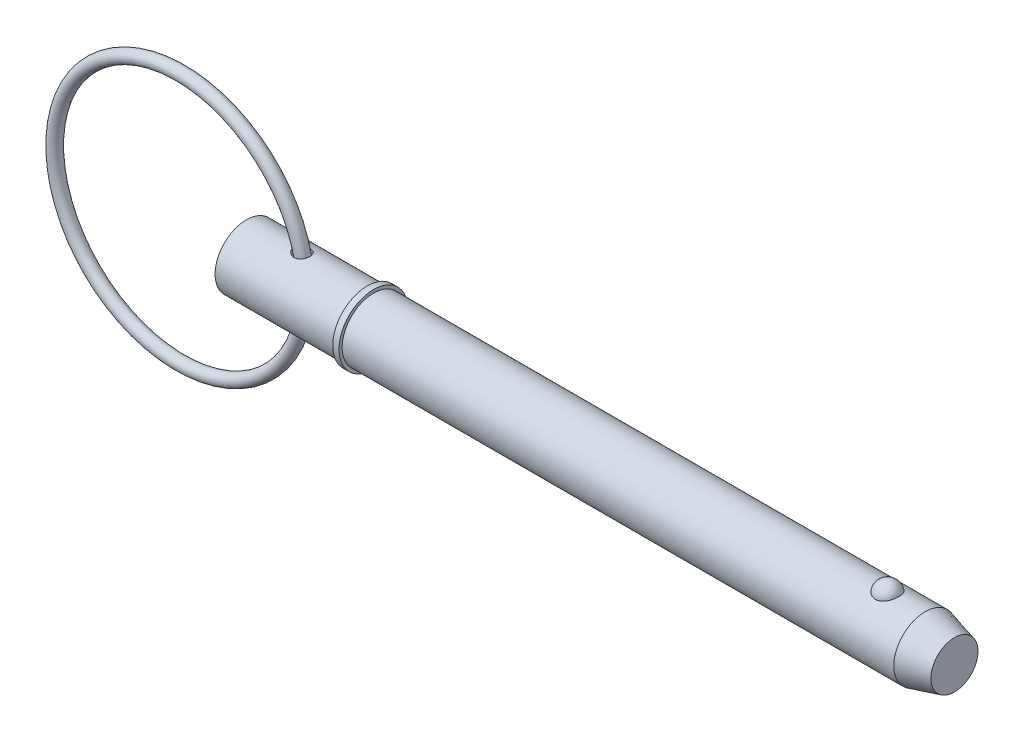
ISO-10303-21;
HEADER;
FILE_DESCRIPTION(('STEP AP214'),'2;1');
FILE_NAME('part.step','',(''),(''),'','','');
FILE_SCHEMA(('AUTOMOTIVE_DESIGN { 1 0 10303 214 1 1 1 1 }'));
ENDSEC;
DATA;
#1=APPLICATION_CONTEXT('core data for automotive mechanical design processes');
#2=APPLICATION_PROTOCOL_DEFINITION('international standard','automotive_design',2000,#1);
#3=PRODUCT_CONTEXT('',#1,'mechanical');
#4=PRODUCT('Part','Part','',(#3));
#5=PRODUCT_RELATED_PRODUCT_CATEGORY('part','',(#4));
#6=PRODUCT_DEFINITION_FORMATION('','',#4);
#7=PRODUCT_DEFINITION_CONTEXT('part definition',#1,'design');
#8=PRODUCT_DEFINITION('design','',#6,#7);
#9=PRODUCT_DEFINITION_SHAPE('','',#8);
#10=(LENGTH_UNIT() NAMED_UNIT(*) SI_UNIT(.MILLI.,.METRE.));
#11=(NAMED_UNIT(*) PLANE_ANGLE_UNIT() SI_UNIT($,.RADIAN.));
#12=(NAMED_UNIT(*) SI_UNIT($,.STERADIAN.) SOLID_ANGLE_UNIT());
#13=UNCERTAINTY_MEASURE_WITH_UNIT(LENGTH_MEASURE(1.E-05),#10,'distance_accuracy_value','');
#14=(GEOMETRIC_REPRESENTATION_CONTEXT(3) GLOBAL_UNCERTAINTY_ASSIGNED_CONTEXT((#13)) GLOBAL_UNIT_ASSIGNED_CONTEXT((#10,
#11,#12)) REPRESENTATION_CONTEXT('',''));
#15=CARTESIAN_POINT('',(0.,0.,0.));
#16=DIRECTION('',(0.,0.,1.));
#17=DIRECTION('',(1.,0.,0.));
#18=AXIS2_PLACEMENT_3D('',#15,#16,#17);
#19=CARTESIAN_POINT('',(-13.3798047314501,0.,0.));
#20=DIRECTION('',(0.,0.,1.));
#21=DIRECTION('',(1.,0.,0.));
#22=AXIS2_PLACEMENT_3D('',#19,#20,#21);
#23=TOROIDAL_SURFACE('',#22,25.4,1.27);
#24=CARTESIAN_POINT('',(13.2901952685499,0.,0.));
#25=VERTEX_POINT('',#24);
#26=VERTEX_LOOP('',#25);
#27=FACE_BOUND('',#26,.T.);
#28=ADVANCED_FACE('P0_F12',(#27),#23,.T.);
#29=CLOSED_SHELL('',(#28));
#30=MANIFOLD_SOLID_BREP('P0_B1',#29);
#31=CARTESIAN_POINT('',(0.,0.,0.));
#32=DIRECTION('',(1.,0.,0.));
#33=DIRECTION('',(0.,0.,-1.));
#34=AXIS2_PLACEMENT_3D('',#31,#32,#33);
#35=CYLINDRICAL_SURFACE('',#34,6.35);
#36=CARTESIAN_POINT('',(9.67500140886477,6.32698634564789,-0.540133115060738));
#37=CARTESIAN_POINT('',(9.70878953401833,6.3197498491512,-0.624879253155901));
#38=CARTESIAN_POINT('',(9.75028044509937,6.31105328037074,-0.706504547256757));
#39=CARTESIAN_POINT('',(9.84659255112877,6.29180070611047,-0.861319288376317));
#40=CARTESIAN_POINT('',(9.90144039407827,6.28124099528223,-0.934491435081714));
#41=CARTESIAN_POINT('',(10.021999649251,6.25949497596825,-1.0704877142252));
#42=CARTESIAN_POINT('',(10.0876589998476,6.2483118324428,-1.1333586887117));
#43=CARTESIAN_POINT('',(10.2280180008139,6.22641783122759,-1.24805262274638));
#44=CARTESIAN_POINT('',(10.3027159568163,6.21570688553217,-1.29987764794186));
#45=CARTESIAN_POINT('',(10.4650889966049,6.19509606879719,-1.39492899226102));
#46=CARTESIAN_POINT('',(10.5533142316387,6.1853135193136,-1.4372443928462));
#47=CARTESIAN_POINT('',(10.7357818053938,6.16871128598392,-1.50691441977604));
#48=CARTESIAN_POINT('',(10.8300253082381,6.16189217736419,-1.53426614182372));
#49=CARTESIAN_POINT('',(11.0227953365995,6.15211299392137,-1.57302798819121));
#50=CARTESIAN_POINT('',(11.1213511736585,6.14918579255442,-1.58430237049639));
#51=CARTESIAN_POINT('',(11.3189518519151,6.1478413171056,-1.58951619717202));
#52=CARTESIAN_POINT('',(11.417996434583,6.14942187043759,-1.58346399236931));
#53=CARTESIAN_POINT('',(11.6070859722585,6.15678569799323,-1.55457003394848));
#54=CARTESIAN_POINT('',(11.6973059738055,6.16229943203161,-1.53280404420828));
#55=CARTESIAN_POINT('',(11.8723373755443,6.176630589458,-1.4739892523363));
#56=CARTESIAN_POINT('',(11.9571502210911,6.185447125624,-1.43694455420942));
#57=CARTESIAN_POINT('',(12.1146737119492,6.20482821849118,-1.3507217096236));
#58=CARTESIAN_POINT('',(12.1877743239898,6.21528554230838,-1.30222952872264));
#59=CARTESIAN_POINT('',(12.324618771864,6.23705116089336,-1.19362916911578));
#60=CARTESIAN_POINT('',(12.3883628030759,6.24835943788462,-1.1335212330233));
#61=CARTESIAN_POINT('',(12.5046662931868,6.27053957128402,-1.00357204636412));
#62=CARTESIAN_POINT('',(12.5572571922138,6.28141258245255,-0.933759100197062));
#63=CARTESIAN_POINT('',(12.6502125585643,6.30157953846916,-0.786214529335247));
#64=CARTESIAN_POINT('',(12.6905764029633,6.31087340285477,-0.708482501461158));
#65=CARTESIAN_POINT('',(12.7585531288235,6.32699259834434,-0.546246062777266));
#66=CARTESIAN_POINT('',(12.7860022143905,6.33378599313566,-0.461669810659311));
#67=CARTESIAN_POINT('',(12.8267605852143,6.34401050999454,-0.288980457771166));
#68=CARTESIAN_POINT('',(12.8400695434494,6.34744155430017,-0.200867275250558));
#69=CARTESIAN_POINT('',(12.8522644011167,6.35058177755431,-0.0231943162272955));
#70=CARTESIAN_POINT('',(12.8510870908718,6.35027464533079,0.0663700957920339));
#71=CARTESIAN_POINT('',(12.8341831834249,6.34593169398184,0.244024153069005));
#72=CARTESIAN_POINT('',(12.8184563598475,6.341895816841,0.332113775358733));
#73=CARTESIAN_POINT('',(12.7728208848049,6.33052992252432,0.504322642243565));
#74=CARTESIAN_POINT('',(12.7429114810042,6.32319973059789,0.588441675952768));
#75=CARTESIAN_POINT('',(12.6696162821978,6.30604116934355,0.750316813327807));
#76=CARTESIAN_POINT('',(12.6262302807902,6.29621276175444,0.828072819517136));
#77=CARTESIAN_POINT('',(12.5270856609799,6.27515240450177,0.974918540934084));
#78=CARTESIAN_POINT('',(12.4713403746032,6.26392197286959,1.04401746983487));
#79=CARTESIAN_POINT('',(12.3488662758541,6.24131002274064,1.1716478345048));
#80=CARTESIAN_POINT('',(12.2821384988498,6.22992851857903,1.23018026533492));
#81=CARTESIAN_POINT('',(12.1401870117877,6.20841765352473,1.33449214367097));
#82=CARTESIAN_POINT('',(12.0650507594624,6.19827734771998,1.38038832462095));
#83=CARTESIAN_POINT('',(11.9079044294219,6.18026478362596,1.45892404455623));
#84=CARTESIAN_POINT('',(11.8258951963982,6.17239224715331,1.49156520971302));
#85=CARTESIAN_POINT('',(11.6581736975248,6.15982613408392,1.54263810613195));
#86=CARTESIAN_POINT('',(11.572502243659,6.15510409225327,1.56119728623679));
#87=CARTESIAN_POINT('',(11.3991899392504,6.14916283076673,1.58443707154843));
#88=CARTESIAN_POINT('',(11.3115488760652,6.14794399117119,1.58911617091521));
#89=CARTESIAN_POINT('',(11.1345547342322,6.14904466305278,1.58485137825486));
#90=CARTESIAN_POINT('',(11.0452104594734,6.15144894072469,1.5755811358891));
#91=CARTESIAN_POINT('',(10.8691479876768,6.15957601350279,1.54349959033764));
#92=CARTESIAN_POINT('',(10.782430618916,6.16529984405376,1.52068406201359));
#93=CARTESIAN_POINT('',(10.6082848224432,6.17983892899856,1.4605156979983));
#94=CARTESIAN_POINT('',(10.5211557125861,6.1888262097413,1.42233764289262));
#95=CARTESIAN_POINT('',(10.3542377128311,6.20874782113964,1.33268652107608));
#96=CARTESIAN_POINT('',(10.2744521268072,6.21968302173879,1.28120750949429));
#97=CARTESIAN_POINT('',(10.120854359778,6.24282707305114,1.16334748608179));
#98=CARTESIAN_POINT('',(10.0474902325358,6.25507146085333,1.09638652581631));
#99=CARTESIAN_POINT('',(9.91368693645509,6.27890019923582,0.950453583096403));
#100=CARTESIAN_POINT('',(9.85324511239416,6.29048468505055,0.87148407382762));
#101=CARTESIAN_POINT('',(9.75037543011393,6.31102161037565,0.707140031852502));
#102=CARTESIAN_POINT('',(9.70726585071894,6.32006820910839,0.622206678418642));
#103=CARTESIAN_POINT('',(9.63775895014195,6.33497125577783,0.445490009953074));
#104=CARTESIAN_POINT('',(9.61134627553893,6.34083063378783,0.35371307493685));
#105=CARTESIAN_POINT('',(9.57891955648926,6.34807071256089,0.177220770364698));
#106=CARTESIAN_POINT('',(9.5709352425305,6.3498832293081,0.0928817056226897));
#107=CARTESIAN_POINT('',(9.56994851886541,6.35010532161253,-0.0758268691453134));
#108=CARTESIAN_POINT('',(9.57692695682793,6.34851924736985,-0.160196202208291));
#109=CARTESIAN_POINT('',(9.59985709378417,6.34339435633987,-0.294043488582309));
#110=CARTESIAN_POINT('',(9.61128951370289,6.34084912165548,-0.34438537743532));
#111=CARTESIAN_POINT('',(9.63933183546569,6.33468615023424,-0.443526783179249));
#112=CARTESIAN_POINT('',(9.65594100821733,6.33106856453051,-0.492326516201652));
#113=CARTESIAN_POINT('',(9.67500140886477,6.32698634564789,-0.540133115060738));
#114=B_SPLINE_CURVE_WITH_KNOTS('',3,(#36,#37,#38,#39,#40,#41,#42,#43,#44,#45,#46,#47,#48,#49,
#50,#51,#52,#53,#54,#55,#56,#57,#58,#59,#60,#61,#62,#63,#64,#65,#66,#67,#68,#69,#70,#71,#72,#73,
#74,#75,#76,#77,#78,#79,#80,#81,#82,#83,#84,#85,#86,#87,#88,#89,#90,#91,#92,#93,#94,#95,#96,#97,
#98,#99,#100,#101,#102,#103,#104,#105,#106,#107,#108,#109,#110,#111,#112,#113),.UNSPECIFIED.,
.T.,.F.,(4,2,2,2,2,2,2,2,2,2,2,2,2,2,2,2,2,2,2,2,2,2,2,2,2,2,2,2,2,2,2,2,2,2,2,2,2,2,4),(0.,
0.274348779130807,0.54924945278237,0.822863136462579,1.09642560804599,1.3900770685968,
1.68378550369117,1.97995934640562,2.27599046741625,2.55347281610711,2.83088067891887,
3.09465189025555,3.35841759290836,3.62142956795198,3.88445494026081,4.1507318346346,
4.4170148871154,4.68446025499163,4.95190978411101,5.21937350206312,5.48684131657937,
5.75402200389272,6.02117751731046,6.28577524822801,6.55034050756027,6.81248178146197,
7.0746514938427,7.34305086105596,7.61153399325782,7.89692981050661,8.18245340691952,
8.48120635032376,8.77989784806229,9.06530254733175,9.35044442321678,9.60331609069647,
9.85586427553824,10.010650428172,10.1654147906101),.UNSPECIFIED.);
#115=CARTESIAN_POINT('',(9.67500140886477,6.32698634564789,-0.540133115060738));
#116=VERTEX_POINT('',#115);
#117=EDGE_CURVE('P1_E42',#116,#116,#114,.T.);
#118=ORIENTED_EDGE('',*,*,#117,.T.);
#119=EDGE_LOOP('',(#118));
#120=FACE_BOUND('',#119,.T.);
#121=CARTESIAN_POINT('',(0.,0.,0.));
#122=DIRECTION('',(1.,0.,0.));
#123=DIRECTION('',(0.,0.,-1.));
#124=AXIS2_PLACEMENT_3D('',#121,#122,#123);
#125=CIRCLE('',#124,6.35);
#126=CARTESIAN_POINT('',(0.,0.,-6.35));
#127=VERTEX_POINT('',#126);
#128=EDGE_CURVE('P1_E9',#127,#127,#125,.T.);
#129=ORIENTED_EDGE('',*,*,#128,.T.);
#130=EDGE_LOOP('',(#129));
#131=FACE_BOUND('',#130,.T.);
#132=CARTESIAN_POINT('',(24.43,0.,0.));
#133=DIRECTION('',(1.,0.,0.));
#134=DIRECTION('',(0.,0.,-1.));
#135=AXIS2_PLACEMENT_3D('',#132,#133,#134);
#136=CIRCLE('',#135,6.35);
#137=CARTESIAN_POINT('',(24.43,0.,-6.35));
#138=VERTEX_POINT('',#137);
#139=EDGE_CURVE('P1_E25',#138,#138,#136,.T.);
#140=ORIENTED_EDGE('',*,*,#139,.F.);
#141=EDGE_LOOP('',(#140));
#142=FACE_BOUND('',#141,.T.);
#143=CARTESIAN_POINT('',(9.67500140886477,-6.32698634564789,-0.540133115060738));
#144=CARTESIAN_POINT('',(9.64544894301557,-6.33331515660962,-0.46600258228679));
#145=CARTESIAN_POINT('',(9.62177180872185,-6.33852974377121,-0.389437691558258));
#146=CARTESIAN_POINT('',(9.58727043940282,-6.34619174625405,-0.233330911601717));
#147=CARTESIAN_POINT('',(9.57644043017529,-6.34864040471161,-0.153790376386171));
#148=CARTESIAN_POINT('',(9.56819517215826,-6.3505010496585,0.00612071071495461));
#149=CARTESIAN_POINT('',(9.57079639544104,-6.34990930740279,0.0864921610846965));
#150=CARTESIAN_POINT('',(9.58930797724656,-6.3457478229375,0.245607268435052));
#151=CARTESIAN_POINT('',(9.60522046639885,-6.34217760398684,0.324350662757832));
#152=CARTESIAN_POINT('',(9.64931570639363,-6.3324977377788,0.47727605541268));
#153=CARTESIAN_POINT('',(9.67737525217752,-6.32641361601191,0.551495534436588));
#154=CARTESIAN_POINT('',(9.74451510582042,-6.31231128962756,0.69455132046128));
#155=CARTESIAN_POINT('',(9.78359827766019,-6.30429258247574,0.763386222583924));
#156=CARTESIAN_POINT('',(9.87474700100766,-6.28638332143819,0.899414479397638));
#157=CARTESIAN_POINT('',(9.92757481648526,-6.27639669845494,0.966083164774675));
#158=CARTESIAN_POINT('',(10.042675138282,-6.25596164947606,1.09061181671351));
#159=CARTESIAN_POINT('',(10.1049521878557,-6.24551300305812,1.14846751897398));
#160=CARTESIAN_POINT('',(10.2445505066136,-6.22397505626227,1.26024641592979));
#161=CARTESIAN_POINT('',(10.3227711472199,-6.2129394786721,1.31305951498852));
#162=CARTESIAN_POINT('',(10.4867924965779,-6.19263757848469,1.40570084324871));
#163=CARTESIAN_POINT('',(10.5725962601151,-6.18337197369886,1.44552380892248));
#164=CARTESIAN_POINT('',(10.7543302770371,-6.16725983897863,1.51283687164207));
#165=CARTESIAN_POINT('',(10.8505554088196,-6.16056505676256,1.53957358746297));
#166=CARTESIAN_POINT('',(11.0463546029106,-6.15127671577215,1.57628137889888));
#167=CARTESIAN_POINT('',(11.1459276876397,-6.14868197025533,1.58625730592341));
#168=CARTESIAN_POINT('',(11.3414257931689,-6.14810798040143,1.58848000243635));
#169=CARTESIAN_POINT('',(11.4373417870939,-6.14995283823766,1.58140242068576));
#170=CARTESIAN_POINT('',(11.6262783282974,-6.1577972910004,1.55057566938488));
#171=CARTESIAN_POINT('',(11.719300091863,-6.16379511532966,1.52683360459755));
#172=CARTESIAN_POINT('',(11.8934223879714,-6.17873566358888,1.46514575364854));
#173=CARTESIAN_POINT('',(11.9749048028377,-6.18746207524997,1.42822144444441));
#174=CARTESIAN_POINT('',(12.1301362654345,-6.20693584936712,1.34105645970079));
#175=CARTESIAN_POINT('',(12.2038861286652,-6.21768299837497,1.29081719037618));
#176=CARTESIAN_POINT('',(12.3399792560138,-6.23970077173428,1.17972764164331));
#177=CARTESIAN_POINT('',(12.4025430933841,-6.25095401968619,1.11914355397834));
#178=CARTESIAN_POINT('',(12.5166805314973,-6.27296916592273,0.988307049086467));
#179=CARTESIAN_POINT('',(12.568253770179,-6.28373104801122,0.918054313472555));
#180=CARTESIAN_POINT('',(12.6596230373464,-6.3037060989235,0.769081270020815));
#181=CARTESIAN_POINT('',(12.6992956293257,-6.31290263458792,0.690283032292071));
#182=CARTESIAN_POINT('',(12.7652258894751,-6.32862394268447,0.527011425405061));
#183=CARTESIAN_POINT('',(12.7914829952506,-6.33514860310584,0.442537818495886));
#184=CARTESIAN_POINT('',(12.8301436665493,-6.34487485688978,0.269505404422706));
#185=CARTESIAN_POINT('',(12.8424230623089,-6.34804664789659,0.180917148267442));
#186=CARTESIAN_POINT('',(12.8524214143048,-6.35062347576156,0.00286829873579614));
#187=CARTESIAN_POINT('',(12.8501402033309,-6.35002846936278,-0.0865923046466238));
#188=CARTESIAN_POINT('',(12.8310619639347,-6.34513332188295,-0.263931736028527));
#189=CARTESIAN_POINT('',(12.8142517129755,-6.34082980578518,-0.35180904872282));
#190=CARTESIAN_POINT('',(12.7664911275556,-6.32897674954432,-0.523406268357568));
#191=CARTESIAN_POINT('',(12.7355404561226,-6.3214271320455,-0.607126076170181));
#192=CARTESIAN_POINT('',(12.6602298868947,-6.30390232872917,-0.768030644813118));
#193=CARTESIAN_POINT('',(12.6158695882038,-6.29392707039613,-0.845215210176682));
#194=CARTESIAN_POINT('',(12.5148171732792,-6.2726521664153,-0.990836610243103));
#195=CARTESIAN_POINT('',(12.4581254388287,-6.26135256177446,-1.05927371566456));
#196=CARTESIAN_POINT('',(12.33416419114,-6.2387572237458,-1.18510935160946));
#197=CARTESIAN_POINT('',(12.2669484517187,-6.22746174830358,-1.24256086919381));
#198=CARTESIAN_POINT('',(12.1235592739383,-6.20610255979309,-1.34519464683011));
#199=CARTESIAN_POINT('',(12.0473871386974,-6.19603866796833,-1.39037868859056));
#200=CARTESIAN_POINT('',(11.8892714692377,-6.17839642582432,-1.46678006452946));
#201=CARTESIAN_POINT('',(11.8074126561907,-6.17078838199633,-1.49816605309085));
#202=CARTESIAN_POINT('',(11.6394563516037,-6.15869606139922,-1.54712759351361));
#203=CARTESIAN_POINT('',(11.5533589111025,-6.15421174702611,-1.56470331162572));
#204=CARTESIAN_POINT('',(11.3789660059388,-6.14876652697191,-1.58596734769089));
#205=CARTESIAN_POINT('',(11.2906621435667,-6.1478222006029,-1.58959032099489));
#206=CARTESIAN_POINT('',(11.1146029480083,-6.149490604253,-1.58312110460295));
#207=CARTESIAN_POINT('',(11.0268477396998,-6.1521041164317,-1.57302589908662));
#208=CARTESIAN_POINT('',(10.8498668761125,-6.16071031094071,-1.53898332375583));
#209=CARTESIAN_POINT('',(10.7607726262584,-6.16685908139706,-1.51439468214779));
#210=CARTESIAN_POINT('',(10.5876521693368,-6.18189031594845,-1.45181305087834));
#211=CARTESIAN_POINT('',(10.5036282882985,-6.19077402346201,-1.41381396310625));
#212=CARTESIAN_POINT('',(10.3374228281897,-6.2109378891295,-1.32252480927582));
#213=CARTESIAN_POINT('',(10.255708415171,-6.2223355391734,-1.26840756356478));
#214=CARTESIAN_POINT('',(10.1025645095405,-6.24580740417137,-1.14725208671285));
#215=CARTESIAN_POINT('',(10.0311354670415,-6.25788164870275,-1.08021329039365));
#216=CARTESIAN_POINT('',(9.90472699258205,-6.2806176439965,-0.938710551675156));
#217=CARTESIAN_POINT('',(9.84904456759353,-6.29132066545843,-0.864883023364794));
#218=CARTESIAN_POINT('',(9.75129345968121,-6.31084098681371,-0.708496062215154));
#219=CARTESIAN_POINT('',(9.70921094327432,-6.31966019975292,-0.625945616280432));
#220=CARTESIAN_POINT('',(9.67500140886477,-6.32698634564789,-0.540133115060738));
#221=B_SPLINE_CURVE_WITH_KNOTS('',3,(#143,#144,#145,#146,#147,#148,#149,#150,#151,#152,#153,
#154,#155,#156,#157,#158,#159,#160,#161,#162,#163,#164,#165,#166,#167,#168,#169,#170,#171,#172,
#173,#174,#175,#176,#177,#178,#179,#180,#181,#182,#183,#184,#185,#186,#187,#188,#189,#190,#191,
#192,#193,#194,#195,#196,#197,#198,#199,#200,#201,#202,#203,#204,#205,#206,#207,#208,#209,#210,
#211,#212,#213,#214,#215,#216,#217,#218,#219,#220),.UNSPECIFIED.,.T.,.F.,(4,2,2,2,2,2,2,2,2,2,2,
2,2,2,2,2,2,2,2,2,2,2,2,2,2,2,2,2,2,2,2,2,2,2,2,2,2,2,4),(0.,0.239871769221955,
0.479635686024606,0.719693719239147,0.959790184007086,1.19750645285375,1.43528453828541,
1.69117930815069,1.94719750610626,2.23102979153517,2.51497694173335,2.81376497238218,
3.11246650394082,3.39952951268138,3.68647020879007,3.95479420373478,4.22308987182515,
4.48530700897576,4.74753278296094,5.01239119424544,5.27726070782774,5.54446524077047,
5.81167284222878,6.07912387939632,6.34658129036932,6.61404669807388,6.88150382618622,
7.1476364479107,7.41373039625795,7.67647472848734,7.93921589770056,8.20318607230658,
8.46721428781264,8.74390821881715,9.02072813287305,9.31537622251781,9.61003720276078,
9.88799314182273,10.1656654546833),.UNSPECIFIED.);
#222=CARTESIAN_POINT('',(9.67500140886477,-6.32698634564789,-0.540133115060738));
#223=VERTEX_POINT('',#222);
#224=EDGE_CURVE('P1_E17',#223,#223,#221,.T.);
#225=ORIENTED_EDGE('',*,*,#224,.T.);
#226=EDGE_LOOP('',(#225));
#227=FACE_BOUND('',#226,.T.);
#228=ADVANCED_FACE('P1_F13',(#120,#131,#142,#227),#35,.T.);
#229=CARTESIAN_POINT('',(0.,0.,0.));
#230=DIRECTION('',(1.,0.,0.));
#231=DIRECTION('',(0.,0.,-1.));
#232=AXIS2_PLACEMENT_3D('',#229,#230,#231);
#233=CYLINDRICAL_SURFACE('',#232,6.35);
#234=CARTESIAN_POINT('',(137.255369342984,0.,0.));
#235=DIRECTION('',(1.,0.,0.));
#236=DIRECTION('',(0.,0.,-1.));
#237=AXIS2_PLACEMENT_3D('',#234,#235,#236);
#238=CIRCLE('',#237,6.35);
#239=CARTESIAN_POINT('',(137.255369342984,0.,-6.35));
#240=VERTEX_POINT('',#239);
#241=EDGE_CURVE('P1_E99',#240,#240,#238,.T.);
#242=ORIENTED_EDGE('',*,*,#241,.F.);
#243=EDGE_LOOP('',(#242));
#244=FACE_BOUND('',#243,.T.);
#245=CARTESIAN_POINT('',(25.7,0.,0.));
#246=DIRECTION('',(1.,0.,0.));
#247=DIRECTION('',(0.,0.,-1.));
#248=AXIS2_PLACEMENT_3D('',#245,#246,#247);
#249=CIRCLE('',#248,6.35);
#250=CARTESIAN_POINT('',(25.7,0.,-6.35));
#251=VERTEX_POINT('',#250);
#252=EDGE_CURVE('P1_E96',#251,#251,#249,.T.);
#253=ORIENTED_EDGE('',*,*,#252,.T.);
#254=EDGE_LOOP('',(#253));
#255=FACE_BOUND('',#254,.T.);
#256=CARTESIAN_POINT('',(129.630021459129,5.87502187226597,2.40969251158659));
#257=CARTESIAN_POINT('',(129.505030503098,5.87501645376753,2.40969773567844));
#258=CARTESIAN_POINT('',(129.380080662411,5.87916061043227,2.39967292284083));
#259=CARTESIAN_POINT('',(129.133909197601,5.8952311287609,2.35991730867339));
#260=CARTESIAN_POINT('',(129.012686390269,5.90715499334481,2.33019283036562));
#261=CARTESIAN_POINT('',(128.777517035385,5.93739567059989,2.25201402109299));
#262=CARTESIAN_POINT('',(128.663560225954,5.95570321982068,2.20358681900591));
#263=CARTESIAN_POINT('',(128.44557352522,5.99672067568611,2.08937987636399));
#264=CARTESIAN_POINT('',(128.341545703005,6.01943149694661,2.02359652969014));
#265=CARTESIAN_POINT('',(128.142943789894,6.06760647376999,1.87428969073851));
#266=CARTESIAN_POINT('',(128.048726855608,6.09313095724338,1.79031110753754));
#267=CARTESIAN_POINT('',(127.875255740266,6.14375873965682,1.60800178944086));
#268=CARTESIAN_POINT('',(127.796004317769,6.16886196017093,1.50966841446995));
#269=CARTESIAN_POINT('',(127.650845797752,6.21724600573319,1.29645884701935));
#270=CARTESIAN_POINT('',(127.585688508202,6.24039621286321,1.18104158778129));
#271=CARTESIAN_POINT('',(127.474703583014,6.28117277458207,0.940351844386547));
#272=CARTESIAN_POINT('',(127.428877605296,6.29879865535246,0.815078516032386));
#273=CARTESIAN_POINT('',(127.357023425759,6.32692073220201,0.556494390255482));
#274=CARTESIAN_POINT('',(127.331249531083,6.33732517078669,0.423102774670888));
#275=CARTESIAN_POINT('',(127.300988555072,6.34957673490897,0.153542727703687));
#276=CARTESIAN_POINT('',(127.296500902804,6.35142408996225,0.0173743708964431));
#277=CARTESIAN_POINT('',(127.308865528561,6.34638925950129,-0.253036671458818));
#278=CARTESIAN_POINT('',(127.325594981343,6.33955731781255,-0.387285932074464));
#279=CARTESIAN_POINT('',(127.379843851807,6.31794129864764,-0.650851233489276));
#280=CARTESIAN_POINT('',(127.417363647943,6.30315707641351,-0.780167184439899));
#281=CARTESIAN_POINT('',(127.512500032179,6.26711642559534,-1.03041949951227));
#282=CARTESIAN_POINT('',(127.570143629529,6.24585130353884,-1.1513443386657));
#283=CARTESIAN_POINT('',(127.704352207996,6.19905619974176,-1.38129800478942));
#284=CARTESIAN_POINT('',(127.780918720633,6.17352587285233,-1.49032586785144));
#285=CARTESIAN_POINT('',(127.951753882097,6.12080227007,-1.69393164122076));
#286=CARTESIAN_POINT('',(128.046100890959,6.09360200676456,-1.78844209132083));
#287=CARTESIAN_POINT('',(128.250119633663,6.04070434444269,-1.95970536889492));
#288=CARTESIAN_POINT('',(128.359790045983,6.01500681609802,-2.03645972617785));
#289=CARTESIAN_POINT('',(128.589187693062,5.96867714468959,-2.16845644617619));
#290=CARTESIAN_POINT('',(128.708652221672,5.94794910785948,-2.22412062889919));
#291=CARTESIAN_POINT('',(128.956218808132,5.91340580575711,-2.31440992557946));
#292=CARTESIAN_POINT('',(129.084317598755,5.8995879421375,-2.3490429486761));
#293=CARTESIAN_POINT('',(129.338582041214,5.88111049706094,-2.39491590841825));
#294=CARTESIAN_POINT('',(129.464520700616,5.876025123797,-2.40724512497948));
#295=CARTESIAN_POINT('',(129.716786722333,5.87428980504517,-2.41147867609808));
#296=CARTESIAN_POINT('',(129.843114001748,5.87763817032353,-2.40338710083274));
#297=CARTESIAN_POINT('',(130.088417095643,5.89212921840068,-2.367627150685));
#298=CARTESIAN_POINT('',(130.207499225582,5.90302431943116,-2.34058030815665));
#299=CARTESIAN_POINT('',(130.43924472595,5.93113752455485,-2.26839066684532));
#300=CARTESIAN_POINT('',(130.551907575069,5.94835614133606,-2.22324640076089));
#301=CARTESIAN_POINT('',(130.770400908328,5.98773016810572,-2.11493806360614));
#302=CARTESIAN_POINT('',(130.876028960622,6.00998499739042,-2.05140269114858));
#303=CARTESIAN_POINT('',(131.075300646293,6.05690144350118,-1.90842705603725));
#304=CARTESIAN_POINT('',(131.168941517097,6.08156361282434,-1.82898313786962));
#305=CARTESIAN_POINT('',(131.346675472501,6.13211715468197,-1.65182429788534));
#306=CARTESIAN_POINT('',(131.430055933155,6.15800825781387,-1.55339381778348));
#307=CARTESIAN_POINT('',(131.579790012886,6.20712834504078,-1.34374214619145));
#308=CARTESIAN_POINT('',(131.646140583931,6.23035685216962,-1.23251867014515));
#309=CARTESIAN_POINT('',(131.762345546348,6.27251177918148,-0.996447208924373));
#310=CARTESIAN_POINT('',(131.811607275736,6.29127762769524,-0.871278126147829));
#311=CARTESIAN_POINT('',(131.889614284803,6.3215862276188,-0.613870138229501));
#312=CARTESIAN_POINT('',(131.918359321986,6.33312889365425,-0.481631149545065));
#313=CARTESIAN_POINT('',(131.95477058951,6.34782349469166,-0.213672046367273));
#314=CARTESIAN_POINT('',(131.962413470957,6.35096613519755,-0.0779482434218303));
#315=CARTESIAN_POINT('',(131.956395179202,6.34851322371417,0.192943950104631));
#316=CARTESIAN_POINT('',(131.942734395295,6.3429178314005,0.328112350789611));
#317=CARTESIAN_POINT('',(131.89450361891,6.32360512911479,0.593406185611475));
#318=CARTESIAN_POINT('',(131.860031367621,6.30992579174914,0.723552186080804));
#319=CARTESIAN_POINT('',(131.770953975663,6.27586325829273,0.97583417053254));
#320=CARTESIAN_POINT('',(131.71634761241,6.25547965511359,1.09796966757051));
#321=CARTESIAN_POINT('',(131.58775879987,6.20998183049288,1.33148921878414));
#322=CARTESIAN_POINT('',(131.513674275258,6.18484288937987,1.44281227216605));
#323=CARTESIAN_POINT('',(131.347820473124,6.13258735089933,1.65087683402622));
#324=CARTESIAN_POINT('',(131.256051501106,6.10547078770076,1.74761859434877));
#325=CARTESIAN_POINT('',(131.057183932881,6.05235879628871,1.92350926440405));
#326=CARTESIAN_POINT('',(130.950133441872,6.0263601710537,2.00271146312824));
#327=CARTESIAN_POINT('',(130.723138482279,5.97843747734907,2.1415415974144));
#328=CARTESIAN_POINT('',(130.603191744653,5.95651412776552,2.20116608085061));
#329=CARTESIAN_POINT('',(130.344523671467,5.91812106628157,2.30250570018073));
#330=CARTESIAN_POINT('',(130.20506980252,5.90217533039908,2.34256795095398));
#331=CARTESIAN_POINT('',(129.920397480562,5.88063128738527,2.39615214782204));
#332=CARTESIAN_POINT('',(129.77518174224,5.8750281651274,2.40968644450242));
#333=CARTESIAN_POINT('',(129.630021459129,5.87502187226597,2.40969251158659));
#334=B_SPLINE_CURVE_WITH_KNOTS('',3,(#256,#257,#258,#259,#260,#261,#262,#263,#264,#265,#266,
#267,#268,#269,#270,#271,#272,#273,#274,#275,#276,#277,#278,#279,#280,#281,#282,#283,#284,#285,
#286,#287,#288,#289,#290,#291,#292,#293,#294,#295,#296,#297,#298,#299,#300,#301,#302,#303,#304,
#305,#306,#307,#308,#309,#310,#311,#312,#313,#314,#315,#316,#317,#318,#319,#320,#321,#322,#323,
#324,#325,#326,#327,#328,#329,#330,#331,#332,#333),.UNSPECIFIED.,.T.,.F.,(4,2,2,2,2,2,2,2,2,2,2,
2,2,2,2,2,2,2,2,2,2,2,2,2,2,2,2,2,2,2,2,2,2,2,2,2,2,2,4),(0.,0.374440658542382,
0.748761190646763,1.12254078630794,1.49639810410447,1.88098871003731,2.2656501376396,
2.66741104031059,3.06920639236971,3.47601794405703,3.88281858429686,4.28727498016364,
4.69173873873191,5.09674745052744,5.50178895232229,5.9086591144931,6.31549420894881,
6.71369855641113,7.11175305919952,7.48978077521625,7.86773278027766,8.23383886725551,
8.59997464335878,8.9740904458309,9.34829231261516,9.74122667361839,10.1342313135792,
10.5397522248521,10.9452779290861,11.3512521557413,11.7572189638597,12.1612938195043,
12.5653932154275,12.9716540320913,13.3779078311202,13.7829098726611,14.1879832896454,
14.6230486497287,15.0579114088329),.UNSPECIFIED.);
#335=CARTESIAN_POINT('',(129.630021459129,5.87502187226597,2.40969251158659));
#336=VERTEX_POINT('',#335);
#337=EDGE_CURVE('P1_E34',#336,#336,#334,.T.);
#338=ORIENTED_EDGE('',*,*,#337,.T.);
#339=EDGE_LOOP('',(#338));
#340=FACE_BOUND('',#339,.T.);
#341=ADVANCED_FACE('P1_F46',(#244,#255,#340),#233,.T.);
#342=CARTESIAN_POINT('',(0.,0.,0.));
#343=DIRECTION('',(-1.,0.,0.));
#344=DIRECTION('',(0.,0.,1.));
#345=AXIS2_PLACEMENT_3D('',#342,#343,#344);
#346=PLANE('',#345);
#347=ORIENTED_EDGE('',*,*,#128,.F.);
#348=EDGE_LOOP('',(#347));
#349=FACE_BOUND('',#348,.T.);
#350=ADVANCED_FACE('P1_F15',(#349),#346,.T.);
#351=CARTESIAN_POINT('',(24.43,6.35,0.));
#352=DIRECTION('',(-1.,0.,0.));
#353=DIRECTION('',(0.,0.,1.));
#354=AXIS2_PLACEMENT_3D('',#351,#352,#353);
#355=PLANE('',#354);
#356=ORIENTED_EDGE('',*,*,#139,.T.);
#357=EDGE_LOOP('',(#356));
#358=FACE_BOUND('',#357,.T.);
#359=CARTESIAN_POINT('',(24.43,0.,0.));
#360=DIRECTION('',(1.,0.,0.));
#361=DIRECTION('',(0.,0.,-1.));
#362=AXIS2_PLACEMENT_3D('',#359,#360,#361);
#363=CIRCLE('',#362,6.985);
#364=CARTESIAN_POINT('',(24.43,0.,-6.985));
#365=VERTEX_POINT('',#364);
#366=EDGE_CURVE('P1_E30',#365,#365,#363,.T.);
#367=ORIENTED_EDGE('',*,*,#366,.F.);
#368=EDGE_LOOP('',(#367));
#369=FACE_BOUND('',#368,.T.);
#370=ADVANCED_FACE('P1_F81',(#358,#369),#355,.T.);
#371=CARTESIAN_POINT('',(0.,0.,0.));
#372=DIRECTION('',(1.,0.,0.));
#373=DIRECTION('',(0.,0.,-1.));
#374=AXIS2_PLACEMENT_3D('',#371,#372,#373);
#375=CYLINDRICAL_SURFACE('',#374,6.985);
#376=ORIENTED_EDGE('',*,*,#366,.T.);
#377=EDGE_LOOP('',(#376));
#378=FACE_BOUND('',#377,.T.);
#379=CARTESIAN_POINT('',(25.7,0.,0.));
#380=DIRECTION('',(1.,0.,0.));
#381=DIRECTION('',(0.,0.,-1.));
#382=AXIS2_PLACEMENT_3D('',#379,#380,#381);
#383=CIRCLE('',#382,6.985);
#384=CARTESIAN_POINT('',(25.7,0.,-6.985));
#385=VERTEX_POINT('',#384);
#386=EDGE_CURVE('P1_E95',#385,#385,#383,.T.);
#387=ORIENTED_EDGE('',*,*,#386,.F.);
#388=EDGE_LOOP('',(#387));
#389=FACE_BOUND('',#388,.T.);
#390=ADVANCED_FACE('P1_F68',(#378,#389),#375,.T.);
#391=CARTESIAN_POINT('',(25.7,6.985,0.));
#392=DIRECTION('',(1.,0.,0.));
#393=DIRECTION('',(0.,0.,-1.));
#394=AXIS2_PLACEMENT_3D('',#391,#392,#393);
#395=PLANE('',#394);
#396=ORIENTED_EDGE('',*,*,#386,.T.);
#397=EDGE_LOOP('',(#396));
#398=FACE_BOUND('',#397,.T.);
#399=ORIENTED_EDGE('',*,*,#252,.F.);
#400=EDGE_LOOP('',(#399));
#401=FACE_BOUND('',#400,.T.);
#402=ADVANCED_FACE('P1_F62',(#398,#401),#395,.T.);
#403=CARTESIAN_POINT('',(143.18,0.,0.));
#404=DIRECTION('',(-1.,0.,0.));
#405=DIRECTION('',(0.,0.,1.));
#406=AXIS2_PLACEMENT_3D('',#403,#404,#405);
#407=CONICAL_SURFACE('',#406,4.76250000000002,0.26179938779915);
#408=ORIENTED_EDGE('',*,*,#241,.T.);
#409=EDGE_LOOP('',(#408));
#410=FACE_BOUND('',#409,.T.);
#411=CARTESIAN_POINT('',(143.18,0.,0.));
#412=DIRECTION('',(1.,0.,0.));
#413=DIRECTION('',(0.,0.,-1.));
#414=AXIS2_PLACEMENT_3D('',#411,#412,#413);
#415=CIRCLE('',#414,4.76250000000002);
#416=CARTESIAN_POINT('',(143.18,0.,-4.76250000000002));
#417=VERTEX_POINT('',#416);
#418=EDGE_CURVE('P1_E41',#417,#417,#415,.T.);
#419=ORIENTED_EDGE('',*,*,#418,.F.);
#420=EDGE_LOOP('',(#419));
#421=FACE_BOUND('',#420,.T.);
#422=ADVANCED_FACE('P1_F59',(#410,#421),#407,.T.);
#423=CARTESIAN_POINT('',(143.18,4.76250000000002,0.));
#424=DIRECTION('',(1.,0.,0.));
#425=DIRECTION('',(0.,0.,-1.));
#426=AXIS2_PLACEMENT_3D('',#423,#424,#425);
#427=PLANE('',#426);
#428=ORIENTED_EDGE('',*,*,#418,.T.);
#429=EDGE_LOOP('',(#428));
#430=FACE_BOUND('',#429,.T.);
#431=ADVANCED_FACE('P1_F55',(#430),#427,.T.);
#432=CARTESIAN_POINT('',(129.630021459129,5.71499999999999,0.));
#433=DIRECTION('',(-1.,0.,0.));
#434=DIRECTION('',(0.,1.,0.));
#435=AXIS2_PLACEMENT_3D('',#432,#433,#434);
#436=SPHERICAL_SURFACE('',#435,2.415);
#437=ORIENTED_EDGE('',*,*,#337,.F.);
#438=EDGE_LOOP('',(#437));
#439=FACE_BOUND('',#438,.T.);
#440=ADVANCED_FACE('P1_F50',(#439),#436,.T.);
#441=CARTESIAN_POINT('',(-13.3798047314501,0.,0.));
#442=DIRECTION('',(0.,0.,1.));
#443=DIRECTION('',(1.,0.,0.));
#444=AXIS2_PLACEMENT_3D('',#441,#442,#443);
#445=TOROIDAL_SURFACE('',#444,25.4,1.5875);
#446=ORIENTED_EDGE('',*,*,#224,.F.);
#447=EDGE_LOOP('',(#446));
#448=FACE_BOUND('',#447,.T.);
#449=ORIENTED_EDGE('',*,*,#117,.F.);
#450=EDGE_LOOP('',(#449));
#451=FACE_BOUND('',#450,.T.);
#452=ADVANCED_FACE('P1_F54',(#448,#451),#445,.F.);
#453=CLOSED_SHELL('',(#228,#341,#350,#370,#390,#402,#422,#431,#440,#452));
#454=MANIFOLD_SOLID_BREP('P1_B1',#453);
#455=ADVANCED_BREP_SHAPE_REPRESENTATION('',(#18,#30,#454),#14);
#456=SHAPE_DEFINITION_REPRESENTATION(#9,#455);
ENDSEC;
END-ISO-10303-21;
